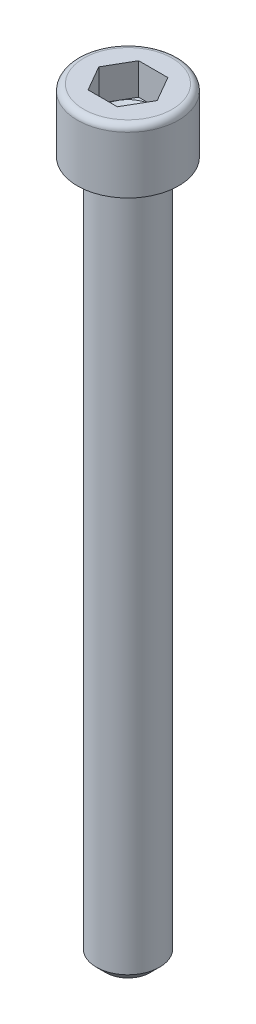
ISO-10303-21;
HEADER;
FILE_DESCRIPTION(('STEP AP214'),'2;1');
FILE_NAME('part.step','',(''),(''),'','','');
FILE_SCHEMA(('AUTOMOTIVE_DESIGN { 1 0 10303 214 1 1 1 1 }'));
ENDSEC;
DATA;
#1=APPLICATION_CONTEXT('core data for automotive mechanical design processes');
#2=APPLICATION_PROTOCOL_DEFINITION('international standard','automotive_design',2000,#1);
#3=PRODUCT_CONTEXT('',#1,'mechanical');
#4=PRODUCT('Part','Part','',(#3));
#5=PRODUCT_RELATED_PRODUCT_CATEGORY('part','',(#4));
#6=PRODUCT_DEFINITION_FORMATION('','',#4);
#7=PRODUCT_DEFINITION_CONTEXT('part definition',#1,'design');
#8=PRODUCT_DEFINITION('design','',#6,#7);
#9=PRODUCT_DEFINITION_SHAPE('','',#8);
#10=(LENGTH_UNIT() NAMED_UNIT(*) SI_UNIT(.MILLI.,.METRE.));
#11=(NAMED_UNIT(*) PLANE_ANGLE_UNIT() SI_UNIT($,.RADIAN.));
#12=(NAMED_UNIT(*) SI_UNIT($,.STERADIAN.) SOLID_ANGLE_UNIT());
#13=UNCERTAINTY_MEASURE_WITH_UNIT(LENGTH_MEASURE(1.E-05),#10,'distance_accuracy_value','');
#14=(GEOMETRIC_REPRESENTATION_CONTEXT(3) GLOBAL_UNCERTAINTY_ASSIGNED_CONTEXT((#13)) GLOBAL_UNIT_ASSIGNED_CONTEXT((#10,
#11,#12)) REPRESENTATION_CONTEXT('',''));
#15=CARTESIAN_POINT('',(0.,0.,0.));
#16=DIRECTION('',(0.,0.,1.));
#17=DIRECTION('',(1.,0.,0.));
#18=AXIS2_PLACEMENT_3D('',#15,#16,#17);
#19=CARTESIAN_POINT('',(4.,10.,0.));
#20=DIRECTION('',(0.,-1.,0.));
#21=DIRECTION('',(1.,0.,0.));
#22=AXIS2_PLACEMENT_3D('',#19,#20,#21);
#23=PLANE('',#22);
#24=CARTESIAN_POINT('',(0.,10.,0.));
#25=DIRECTION('',(0.,1.,0.));
#26=DIRECTION('',(-1.,0.,0.));
#27=AXIS2_PLACEMENT_3D('',#24,#25,#26);
#28=CIRCLE('',#27,7.);
#29=CARTESIAN_POINT('',(-7.,10.,0.));
#30=VERTEX_POINT('',#29);
#31=EDGE_CURVE('E138',#30,#30,#28,.T.);
#32=ORIENTED_EDGE('',*,*,#31,.T.);
#33=EDGE_LOOP('',(#32));
#34=FACE_BOUND('',#33,.T.);
#35=DIRECTION('',(0.499999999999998,0.,0.86602540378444));
#36=VECTOR('',#35,1.);
#37=CARTESIAN_POINT('',(2.30940107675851,10.,-4.));
#38=LINE('',#37,#36);
#39=CARTESIAN_POINT('',(2.30940107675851,10.,-4.));
#40=VERTEX_POINT('',#39);
#41=CARTESIAN_POINT('',(4.618802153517,10.,0.));
#42=VERTEX_POINT('',#41);
#43=EDGE_CURVE('E370',#40,#42,#38,.T.);
#44=ORIENTED_EDGE('',*,*,#43,.T.);
#45=DIRECTION('',(-0.499999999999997,0.,0.86602540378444));
#46=VECTOR('',#45,1.);
#47=CARTESIAN_POINT('',(2.30940107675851,10.,4.));
#48=LINE('',#47,#46);
#49=CARTESIAN_POINT('',(2.30940107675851,10.,4.));
#50=VERTEX_POINT('',#49);
#51=EDGE_CURVE('E373',#42,#50,#48,.T.);
#52=ORIENTED_EDGE('',*,*,#51,.T.);
#53=DIRECTION('',(-1.,0.,0.));
#54=VECTOR('',#53,1.);
#55=CARTESIAN_POINT('',(2.30940107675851,10.,4.));
#56=LINE('',#55,#54);
#57=CARTESIAN_POINT('',(-2.30940107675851,10.,4.));
#58=VERTEX_POINT('',#57);
#59=EDGE_CURVE('E376',#50,#58,#56,.T.);
#60=ORIENTED_EDGE('',*,*,#59,.T.);
#61=DIRECTION('',(-0.499999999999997,0.,-0.86602540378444));
#62=VECTOR('',#61,1.);
#63=CARTESIAN_POINT('',(-2.30940107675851,10.,4.));
#64=LINE('',#63,#62);
#65=CARTESIAN_POINT('',(-4.618802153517,10.,0.));
#66=VERTEX_POINT('',#65);
#67=EDGE_CURVE('E115',#58,#66,#64,.T.);
#68=ORIENTED_EDGE('',*,*,#67,.T.);
#69=DIRECTION('',(0.499999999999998,0.,-0.86602540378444));
#70=VECTOR('',#69,1.);
#71=CARTESIAN_POINT('',(-2.30940107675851,10.,-4.));
#72=LINE('',#71,#70);
#73=CARTESIAN_POINT('',(-2.30940107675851,10.,-4.));
#74=VERTEX_POINT('',#73);
#75=EDGE_CURVE('E367',#66,#74,#72,.T.);
#76=ORIENTED_EDGE('',*,*,#75,.T.);
#77=DIRECTION('',(1.,0.,0.));
#78=VECTOR('',#77,1.);
#79=CARTESIAN_POINT('',(2.30940107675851,10.,-4.));
#80=LINE('',#79,#78);
#81=EDGE_CURVE('E126',#74,#40,#80,.T.);
#82=ORIENTED_EDGE('',*,*,#81,.T.);
#83=EDGE_LOOP('',(#44,#52,#60,#68,#76,#82));
#84=FACE_BOUND('',#83,.T.);
#85=ADVANCED_FACE('F32',(#34,#84),#23,.F.);
#86=CARTESIAN_POINT('',(0.,-110.,0.));
#87=DIRECTION('',(0.,1.,0.));
#88=DIRECTION('',(0.,0.,1.));
#89=AXIS2_PLACEMENT_3D('',#86,#87,#88);
#90=CYLINDRICAL_SURFACE('',#89,5.);
#91=CARTESIAN_POINT('',(0.,-108.5,0.));
#92=DIRECTION('',(0.,1.,0.));
#93=DIRECTION('',(0.,0.,1.));
#94=AXIS2_PLACEMENT_3D('',#91,#92,#93);
#95=CIRCLE('',#94,5.);
#96=CARTESIAN_POINT('',(0.,-108.5,5.));
#97=VERTEX_POINT('',#96);
#98=EDGE_CURVE('E40',#97,#97,#95,.T.);
#99=ORIENTED_EDGE('',*,*,#98,.T.);
#100=EDGE_LOOP('',(#99));
#101=FACE_BOUND('',#100,.T.);
#102=CARTESIAN_POINT('',(0.,0.,0.));
#103=DIRECTION('',(0.,1.,0.));
#104=DIRECTION('',(0.,0.,1.));
#105=AXIS2_PLACEMENT_3D('',#102,#103,#104);
#106=CIRCLE('',#105,5.);
#107=CARTESIAN_POINT('',(0.,0.,5.));
#108=VERTEX_POINT('',#107);
#109=EDGE_CURVE('E148',#108,#108,#106,.T.);
#110=ORIENTED_EDGE('',*,*,#109,.F.);
#111=EDGE_LOOP('',(#110));
#112=FACE_BOUND('',#111,.T.);
#113=ADVANCED_FACE('F153',(#101,#112),#90,.T.);
#114=CARTESIAN_POINT('',(0.,-110.,0.));
#115=DIRECTION('',(0.,1.,0.));
#116=DIRECTION('',(0.,0.,1.));
#117=AXIS2_PLACEMENT_3D('',#114,#115,#116);
#118=PLANE('',#117);
#119=CARTESIAN_POINT('',(0.,-110.,0.));
#120=DIRECTION('',(0.,1.,0.));
#121=DIRECTION('',(0.,0.,1.));
#122=AXIS2_PLACEMENT_3D('',#119,#120,#121);
#123=CIRCLE('',#122,3.5);
#124=CARTESIAN_POINT('',(0.,-110.,3.5));
#125=VERTEX_POINT('',#124);
#126=EDGE_CURVE('E11',#125,#125,#123,.F.);
#127=ORIENTED_EDGE('',*,*,#126,.T.);
#128=EDGE_LOOP('',(#127));
#129=FACE_BOUND('',#128,.T.);
#130=ADVANCED_FACE('F158',(#129),#118,.F.);
#131=CARTESIAN_POINT('',(0.,-108.5,0.));
#132=DIRECTION('',(0.,1.,0.));
#133=DIRECTION('',(0.,0.,1.));
#134=AXIS2_PLACEMENT_3D('',#131,#132,#133);
#135=CONICAL_SURFACE('',#134,5.,0.785398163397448);
#136=ORIENTED_EDGE('',*,*,#126,.F.);
#137=EDGE_LOOP('',(#136));
#138=FACE_BOUND('',#137,.T.);
#139=ORIENTED_EDGE('',*,*,#98,.F.);
#140=EDGE_LOOP('',(#139));
#141=FACE_BOUND('',#140,.T.);
#142=ADVANCED_FACE('F34',(#138,#141),#135,.T.);
#143=CARTESIAN_POINT('',(0.,0.,0.));
#144=DIRECTION('',(0.,1.,0.));
#145=DIRECTION('',(-1.,0.,0.));
#146=AXIS2_PLACEMENT_3D('',#143,#144,#145);
#147=PLANE('',#146);
#148=ORIENTED_EDGE('',*,*,#109,.T.);
#149=EDGE_LOOP('',(#148));
#150=FACE_BOUND('',#149,.T.);
#151=CARTESIAN_POINT('',(0.,0.,0.));
#152=DIRECTION('',(0.,1.,0.));
#153=DIRECTION('',(-1.,0.,0.));
#154=AXIS2_PLACEMENT_3D('',#151,#152,#153);
#155=CIRCLE('',#154,8.);
#156=CARTESIAN_POINT('',(-8.,0.,0.));
#157=VERTEX_POINT('',#156);
#158=EDGE_CURVE('E145',#157,#157,#155,.T.);
#159=ORIENTED_EDGE('',*,*,#158,.F.);
#160=EDGE_LOOP('',(#159));
#161=FACE_BOUND('',#160,.T.);
#162=ADVANCED_FACE('F157',(#150,#161),#147,.F.);
#163=CARTESIAN_POINT('',(0.,10.,0.));
#164=DIRECTION('',(0.,1.,0.));
#165=DIRECTION('',(-1.,0.,0.));
#166=AXIS2_PLACEMENT_3D('',#163,#164,#165);
#167=CYLINDRICAL_SURFACE('',#166,8.);
#168=CARTESIAN_POINT('',(0.,9.,0.));
#169=DIRECTION('',(0.,1.,0.));
#170=DIRECTION('',(-1.,0.,0.));
#171=AXIS2_PLACEMENT_3D('',#168,#169,#170);
#172=CIRCLE('',#171,8.);
#173=CARTESIAN_POINT('',(-8.,9.,0.));
#174=VERTEX_POINT('',#173);
#175=EDGE_CURVE('E142',#174,#174,#172,.T.);
#176=ORIENTED_EDGE('',*,*,#175,.F.);
#177=EDGE_LOOP('',(#176));
#178=FACE_BOUND('',#177,.T.);
#179=ORIENTED_EDGE('',*,*,#158,.T.);
#180=EDGE_LOOP('',(#179));
#181=FACE_BOUND('',#180,.T.);
#182=ADVANCED_FACE('F164',(#178,#181),#167,.T.);
#183=CARTESIAN_POINT('',(0.,9.,0.));
#184=DIRECTION('',(0.,1.,0.));
#185=DIRECTION('',(-1.,0.,0.));
#186=AXIS2_PLACEMENT_3D('',#183,#184,#185);
#187=TOROIDAL_SURFACE('',#186,7.,0.999999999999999);
#188=ORIENTED_EDGE('',*,*,#31,.F.);
#189=EDGE_LOOP('',(#188));
#190=FACE_BOUND('',#189,.T.);
#191=ORIENTED_EDGE('',*,*,#175,.T.);
#192=EDGE_LOOP('',(#191));
#193=FACE_BOUND('',#192,.T.);
#194=ADVANCED_FACE('F181',(#190,#193),#187,.T.);
#195=CARTESIAN_POINT('',(-2.30940107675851,5.,-4.));
#196=DIRECTION('',(0.86602540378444,0.,0.499999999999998));
#197=DIRECTION('',(0.499999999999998,0.,-0.86602540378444));
#198=AXIS2_PLACEMENT_3D('',#195,#196,#197);
#199=PLANE('',#198);
#200=ORIENTED_EDGE('',*,*,#75,.F.);
#201=DIRECTION('',(0.,1.,0.));
#202=VECTOR('',#201,1.);
#203=CARTESIAN_POINT('',(-4.618802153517,5.,0.));
#204=LINE('',#203,#202);
#205=CARTESIAN_POINT('',(-4.618802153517,5.,0.));
#206=VERTEX_POINT('',#205);
#207=EDGE_CURVE('E362',#206,#66,#204,.T.);
#208=ORIENTED_EDGE('',*,*,#207,.F.);
#209=DIRECTION('',(0.499999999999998,0.,-0.86602540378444));
#210=VECTOR('',#209,1.);
#211=CARTESIAN_POINT('',(-2.30940107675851,5.,-4.));
#212=LINE('',#211,#210);
#213=CARTESIAN_POINT('',(-3.46410161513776,5.,-1.99999999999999));
#214=VERTEX_POINT('',#213);
#215=EDGE_CURVE('E111',#206,#214,#212,.T.);
#216=ORIENTED_EDGE('',*,*,#215,.T.);
#217=CARTESIAN_POINT('',(-2.30940107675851,5.,-4.));
#218=VERTEX_POINT('',#217);
#219=EDGE_CURVE('E105',#214,#218,#212,.T.);
#220=ORIENTED_EDGE('',*,*,#219,.T.);
#221=DIRECTION('',(0.,1.,0.));
#222=VECTOR('',#221,1.);
#223=CARTESIAN_POINT('',(-2.30940107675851,5.,-4.));
#224=LINE('',#223,#222);
#225=EDGE_CURVE('E107',#218,#74,#224,.T.);
#226=ORIENTED_EDGE('',*,*,#225,.T.);
#227=EDGE_LOOP('',(#200,#208,#216,#220,#226));
#228=FACE_BOUND('',#227,.T.);
#229=ADVANCED_FACE('F106',(#228),#199,.T.);
#230=CARTESIAN_POINT('',(2.30940107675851,5.,-4.));
#231=DIRECTION('',(0.,0.,1.));
#232=DIRECTION('',(1.,0.,0.));
#233=AXIS2_PLACEMENT_3D('',#230,#231,#232);
#234=PLANE('',#233);
#235=ORIENTED_EDGE('',*,*,#81,.F.);
#236=ORIENTED_EDGE('',*,*,#225,.F.);
#237=DIRECTION('',(1.,0.,0.));
#238=VECTOR('',#237,1.);
#239=CARTESIAN_POINT('',(2.30940107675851,5.,-4.));
#240=LINE('',#239,#238);
#241=CARTESIAN_POINT('',(0.,5.,-4.));
#242=VERTEX_POINT('',#241);
#243=EDGE_CURVE('E47',#218,#242,#240,.T.);
#244=ORIENTED_EDGE('',*,*,#243,.T.);
#245=CARTESIAN_POINT('',(2.30940107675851,5.,-4.));
#246=VERTEX_POINT('',#245);
#247=EDGE_CURVE('E121',#242,#246,#240,.T.);
#248=ORIENTED_EDGE('',*,*,#247,.T.);
#249=DIRECTION('',(0.,1.,0.));
#250=VECTOR('',#249,1.);
#251=CARTESIAN_POINT('',(2.30940107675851,5.,-4.));
#252=LINE('',#251,#250);
#253=EDGE_CURVE('E128',#246,#40,#252,.T.);
#254=ORIENTED_EDGE('',*,*,#253,.T.);
#255=EDGE_LOOP('',(#235,#236,#244,#248,#254));
#256=FACE_BOUND('',#255,.T.);
#257=ADVANCED_FACE('F123',(#256),#234,.T.);
#258=CARTESIAN_POINT('',(2.30940107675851,5.,-4.));
#259=DIRECTION('',(-0.86602540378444,0.,0.499999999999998));
#260=DIRECTION('',(0.499999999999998,0.,0.86602540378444));
#261=AXIS2_PLACEMENT_3D('',#258,#259,#260);
#262=PLANE('',#261);
#263=ORIENTED_EDGE('',*,*,#43,.F.);
#264=ORIENTED_EDGE('',*,*,#253,.F.);
#265=DIRECTION('',(0.499999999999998,0.,0.86602540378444));
#266=VECTOR('',#265,1.);
#267=CARTESIAN_POINT('',(2.30940107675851,5.,-4.));
#268=LINE('',#267,#266);
#269=CARTESIAN_POINT('',(3.46410161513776,5.,-1.99999999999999));
#270=VERTEX_POINT('',#269);
#271=EDGE_CURVE('E395',#246,#270,#268,.T.);
#272=ORIENTED_EDGE('',*,*,#271,.T.);
#273=CARTESIAN_POINT('',(4.618802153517,5.,0.));
#274=VERTEX_POINT('',#273);
#275=EDGE_CURVE('E120',#270,#274,#268,.T.);
#276=ORIENTED_EDGE('',*,*,#275,.T.);
#277=DIRECTION('',(0.,1.,0.));
#278=VECTOR('',#277,1.);
#279=CARTESIAN_POINT('',(4.618802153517,5.,0.));
#280=LINE('',#279,#278);
#281=EDGE_CURVE('E133',#274,#42,#280,.T.);
#282=ORIENTED_EDGE('',*,*,#281,.T.);
#283=EDGE_LOOP('',(#263,#264,#272,#276,#282));
#284=FACE_BOUND('',#283,.T.);
#285=ADVANCED_FACE('F211',(#284),#262,.T.);
#286=CARTESIAN_POINT('',(2.30940107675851,5.,4.));
#287=DIRECTION('',(-0.86602540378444,0.,-0.499999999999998));
#288=DIRECTION('',(-0.499999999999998,0.,0.86602540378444));
#289=AXIS2_PLACEMENT_3D('',#286,#287,#288);
#290=PLANE('',#289);
#291=ORIENTED_EDGE('',*,*,#51,.F.);
#292=ORIENTED_EDGE('',*,*,#281,.F.);
#293=DIRECTION('',(-0.499999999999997,0.,0.86602540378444));
#294=VECTOR('',#293,1.);
#295=CARTESIAN_POINT('',(2.30940107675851,5.,4.));
#296=LINE('',#295,#294);
#297=CARTESIAN_POINT('',(3.46410161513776,5.,1.99999999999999));
#298=VERTEX_POINT('',#297);
#299=EDGE_CURVE('E393',#274,#298,#296,.T.);
#300=ORIENTED_EDGE('',*,*,#299,.T.);
#301=CARTESIAN_POINT('',(2.30940107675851,5.,4.));
#302=VERTEX_POINT('',#301);
#303=EDGE_CURVE('E394',#298,#302,#296,.T.);
#304=ORIENTED_EDGE('',*,*,#303,.T.);
#305=DIRECTION('',(0.,1.,0.));
#306=VECTOR('',#305,1.);
#307=CARTESIAN_POINT('',(2.30940107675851,5.,4.));
#308=LINE('',#307,#306);
#309=EDGE_CURVE('E382',#302,#50,#308,.T.);
#310=ORIENTED_EDGE('',*,*,#309,.T.);
#311=EDGE_LOOP('',(#291,#292,#300,#304,#310));
#312=FACE_BOUND('',#311,.T.);
#313=ADVANCED_FACE('F218',(#312),#290,.T.);
#314=CARTESIAN_POINT('',(2.30940107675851,5.,4.));
#315=DIRECTION('',(0.,0.,-1.));
#316=DIRECTION('',(-1.,0.,0.));
#317=AXIS2_PLACEMENT_3D('',#314,#315,#316);
#318=PLANE('',#317);
#319=ORIENTED_EDGE('',*,*,#59,.F.);
#320=ORIENTED_EDGE('',*,*,#309,.F.);
#321=DIRECTION('',(-1.,0.,0.));
#322=VECTOR('',#321,1.);
#323=CARTESIAN_POINT('',(2.30940107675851,5.,4.));
#324=LINE('',#323,#322);
#325=CARTESIAN_POINT('',(0.,5.,4.));
#326=VERTEX_POINT('',#325);
#327=EDGE_CURVE('E357',#302,#326,#324,.T.);
#328=ORIENTED_EDGE('',*,*,#327,.T.);
#329=CARTESIAN_POINT('',(-2.30940107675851,5.,4.));
#330=VERTEX_POINT('',#329);
#331=EDGE_CURVE('E353',#326,#330,#324,.T.);
#332=ORIENTED_EDGE('',*,*,#331,.T.);
#333=DIRECTION('',(0.,1.,0.));
#334=VECTOR('',#333,1.);
#335=CARTESIAN_POINT('',(-2.30940107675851,5.,4.));
#336=LINE('',#335,#334);
#337=EDGE_CURVE('E361',#330,#58,#336,.T.);
#338=ORIENTED_EDGE('',*,*,#337,.T.);
#339=EDGE_LOOP('',(#319,#320,#328,#332,#338));
#340=FACE_BOUND('',#339,.T.);
#341=ADVANCED_FACE('F226',(#340),#318,.T.);
#342=CARTESIAN_POINT('',(-2.30940107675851,5.,4.));
#343=DIRECTION('',(0.86602540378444,0.,-0.499999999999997));
#344=DIRECTION('',(-0.499999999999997,0.,-0.86602540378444));
#345=AXIS2_PLACEMENT_3D('',#342,#343,#344);
#346=PLANE('',#345);
#347=ORIENTED_EDGE('',*,*,#67,.F.);
#348=ORIENTED_EDGE('',*,*,#337,.F.);
#349=DIRECTION('',(-0.499999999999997,0.,-0.86602540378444));
#350=VECTOR('',#349,1.);
#351=CARTESIAN_POINT('',(-2.30940107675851,5.,4.));
#352=LINE('',#351,#350);
#353=CARTESIAN_POINT('',(-3.46410161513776,5.,1.99999999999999));
#354=VERTEX_POINT('',#353);
#355=EDGE_CURVE('E352',#330,#354,#352,.T.);
#356=ORIENTED_EDGE('',*,*,#355,.T.);
#357=EDGE_CURVE('E355',#354,#206,#352,.T.);
#358=ORIENTED_EDGE('',*,*,#357,.T.);
#359=ORIENTED_EDGE('',*,*,#207,.T.);
#360=EDGE_LOOP('',(#347,#348,#356,#358,#359));
#361=FACE_BOUND('',#360,.T.);
#362=ADVANCED_FACE('F234',(#361),#346,.T.);
#363=CARTESIAN_POINT('',(-6.92820323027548,5.,4.));
#364=DIRECTION('',(0.,-1.,0.));
#365=DIRECTION('',(0.,0.,-1.));
#366=AXIS2_PLACEMENT_3D('',#363,#364,#365);
#367=PLANE('',#366);
#368=ORIENTED_EDGE('',*,*,#243,.F.);
#369=ORIENTED_EDGE('',*,*,#219,.F.);
#370=CARTESIAN_POINT('',(0.,5.,0.));
#371=DIRECTION('',(0.,1.,0.));
#372=DIRECTION('',(-1.,0.,0.));
#373=AXIS2_PLACEMENT_3D('',#370,#371,#372);
#374=CIRCLE('',#373,4.);
#375=EDGE_CURVE('E118',#242,#214,#374,.T.);
#376=ORIENTED_EDGE('',*,*,#375,.F.);
#377=EDGE_LOOP('',(#368,#369,#376));
#378=FACE_BOUND('',#377,.T.);
#379=ADVANCED_FACE('F117',(#378),#367,.F.);
#380=ORIENTED_EDGE('',*,*,#215,.F.);
#381=ORIENTED_EDGE('',*,*,#357,.F.);
#382=EDGE_CURVE('E127',#214,#354,#374,.T.);
#383=ORIENTED_EDGE('',*,*,#382,.F.);
#384=EDGE_LOOP('',(#380,#381,#383));
#385=FACE_BOUND('',#384,.T.);
#386=ADVANCED_FACE('F249',(#385),#367,.F.);
#387=ORIENTED_EDGE('',*,*,#355,.F.);
#388=ORIENTED_EDGE('',*,*,#331,.F.);
#389=EDGE_CURVE('E132',#354,#326,#374,.T.);
#390=ORIENTED_EDGE('',*,*,#389,.F.);
#391=EDGE_LOOP('',(#387,#388,#390));
#392=FACE_BOUND('',#391,.T.);
#393=ADVANCED_FACE('F257',(#392),#367,.F.);
#394=ORIENTED_EDGE('',*,*,#327,.F.);
#395=ORIENTED_EDGE('',*,*,#303,.F.);
#396=EDGE_CURVE('E139',#326,#298,#374,.T.);
#397=ORIENTED_EDGE('',*,*,#396,.F.);
#398=EDGE_LOOP('',(#394,#395,#397));
#399=FACE_BOUND('',#398,.T.);
#400=ADVANCED_FACE('F264',(#399),#367,.F.);
#401=ORIENTED_EDGE('',*,*,#299,.F.);
#402=ORIENTED_EDGE('',*,*,#275,.F.);
#403=EDGE_CURVE('E399',#298,#270,#374,.T.);
#404=ORIENTED_EDGE('',*,*,#403,.F.);
#405=EDGE_LOOP('',(#401,#402,#404));
#406=FACE_BOUND('',#405,.T.);
#407=ADVANCED_FACE('F271',(#406),#367,.F.);
#408=ORIENTED_EDGE('',*,*,#271,.F.);
#409=ORIENTED_EDGE('',*,*,#247,.F.);
#410=EDGE_CURVE('E398',#270,#242,#374,.T.);
#411=ORIENTED_EDGE('',*,*,#410,.F.);
#412=EDGE_LOOP('',(#408,#409,#411));
#413=FACE_BOUND('',#412,.T.);
#414=ADVANCED_FACE('F251',(#413),#367,.F.);
#415=CARTESIAN_POINT('',(0.,5.,0.));
#416=DIRECTION('',(0.,1.,0.));
#417=DIRECTION('',(-1.,0.,0.));
#418=AXIS2_PLACEMENT_3D('',#415,#416,#417);
#419=CONICAL_SURFACE('',#418,4.,1.04719755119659);
#420=CARTESIAN_POINT('',(0.,2.69059892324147,0.));
#421=VERTEX_POINT('',#420);
#422=VERTEX_LOOP('',#421);
#423=FACE_BOUND('',#422,.T.);
#424=ORIENTED_EDGE('',*,*,#389,.T.);
#425=ORIENTED_EDGE('',*,*,#396,.T.);
#426=ORIENTED_EDGE('',*,*,#403,.T.);
#427=ORIENTED_EDGE('',*,*,#410,.T.);
#428=ORIENTED_EDGE('',*,*,#375,.T.);
#429=ORIENTED_EDGE('',*,*,#382,.T.);
#430=EDGE_LOOP('',(#424,#425,#426,#427,#428,#429));
#431=FACE_BOUND('',#430,.T.);
#432=ADVANCED_FACE('F179',(#423,#431),#419,.F.);
#433=CLOSED_SHELL('',(#85,#113,#130,#142,#162,#182,#194,#229,#257,#285,#313,#341,#362,#379,#386,
#393,#400,#407,#414,#432));
#434=MANIFOLD_SOLID_BREP('B2',#433);
#435=ADVANCED_BREP_SHAPE_REPRESENTATION('',(#18,#434),#14);
#436=SHAPE_DEFINITION_REPRESENTATION(#9,#435);
ENDSEC;
END-ISO-10303-21;
